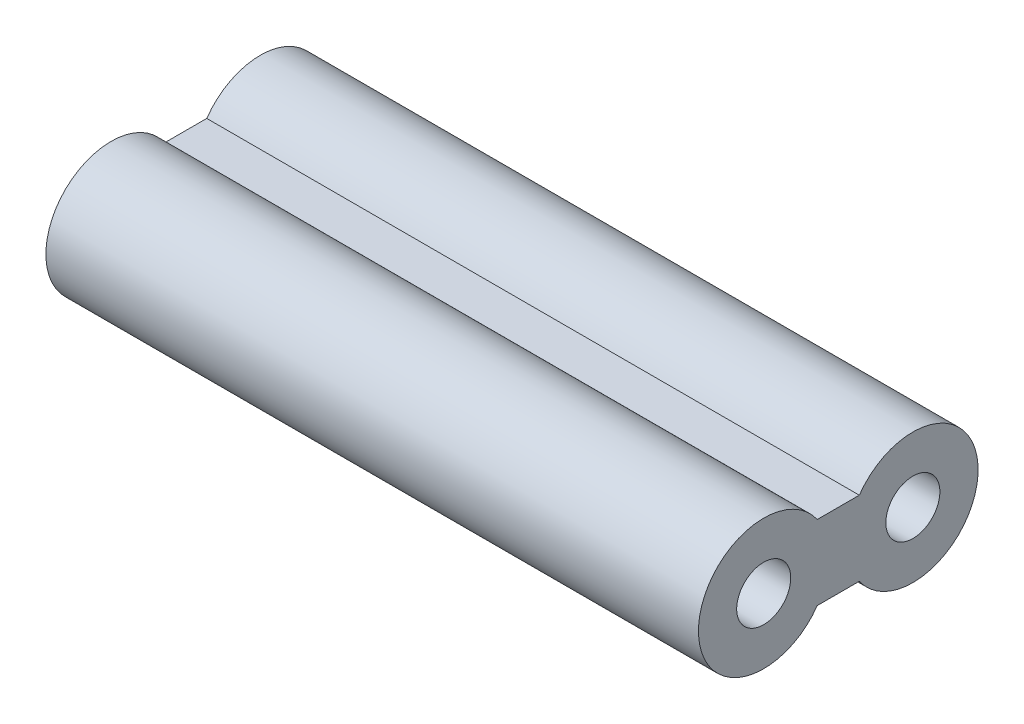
ISO-10303-21;
HEADER;
FILE_DESCRIPTION(('STEP AP214'),'2;1');
FILE_NAME('part.step','',(''),(''),'','','');
FILE_SCHEMA(('AUTOMOTIVE_DESIGN { 1 0 10303 214 1 1 1 1 }'));
ENDSEC;
DATA;
#1=APPLICATION_CONTEXT('core data for automotive mechanical design processes');
#2=APPLICATION_PROTOCOL_DEFINITION('international standard','automotive_design',2000,#1);
#3=PRODUCT_CONTEXT('',#1,'mechanical');
#4=PRODUCT('Part','Part','',(#3));
#5=PRODUCT_RELATED_PRODUCT_CATEGORY('part','',(#4));
#6=PRODUCT_DEFINITION_FORMATION('','',#4);
#7=PRODUCT_DEFINITION_CONTEXT('part definition',#1,'design');
#8=PRODUCT_DEFINITION('design','',#6,#7);
#9=PRODUCT_DEFINITION_SHAPE('','',#8);
#10=(LENGTH_UNIT() NAMED_UNIT(*) SI_UNIT(.MILLI.,.METRE.));
#11=(NAMED_UNIT(*) PLANE_ANGLE_UNIT() SI_UNIT($,.RADIAN.));
#12=(NAMED_UNIT(*) SI_UNIT($,.STERADIAN.) SOLID_ANGLE_UNIT());
#13=UNCERTAINTY_MEASURE_WITH_UNIT(LENGTH_MEASURE(1.E-05),#10,'distance_accuracy_value','');
#14=(GEOMETRIC_REPRESENTATION_CONTEXT(3) GLOBAL_UNCERTAINTY_ASSIGNED_CONTEXT((#13)) GLOBAL_UNIT_ASSIGNED_CONTEXT((#10,
#11,#12)) REPRESENTATION_CONTEXT('',''));
#15=CARTESIAN_POINT('',(0.,0.,0.));
#16=DIRECTION('',(0.,0.,1.));
#17=DIRECTION('',(1.,0.,0.));
#18=AXIS2_PLACEMENT_3D('',#15,#16,#17);
#19=CARTESIAN_POINT('',(17.5,0.,0.));
#20=DIRECTION('',(1.,0.,0.));
#21=DIRECTION('',(0.,0.,-1.));
#22=AXIS2_PLACEMENT_3D('',#19,#20,#21);
#23=PLANE('',#22);
#24=CARTESIAN_POINT('',(17.5,0.,0.));
#25=DIRECTION('',(1.,0.,0.));
#26=DIRECTION('',(0.,0.,-1.));
#27=AXIS2_PLACEMENT_3D('',#24,#25,#26);
#28=CIRCLE('',#27,3.5);
#29=CARTESIAN_POINT('',(17.5,2.,-2.87228132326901));
#30=VERTEX_POINT('',#29);
#31=CARTESIAN_POINT('',(17.5,-2.,-2.87228132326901));
#32=VERTEX_POINT('',#31);
#33=EDGE_CURVE('E11',#30,#32,#28,.T.);
#34=ORIENTED_EDGE('',*,*,#33,.T.);
#35=DIRECTION('',(0.,0.,-1.));
#36=VECTOR('',#35,1.);
#37=CARTESIAN_POINT('',(17.5,-2.,-2.87228132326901));
#38=LINE('',#37,#36);
#39=CARTESIAN_POINT('',(17.5,-2.,-5.12771867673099));
#40=VERTEX_POINT('',#39);
#41=EDGE_CURVE('E76',#32,#40,#38,.T.);
#42=ORIENTED_EDGE('',*,*,#41,.T.);
#43=CARTESIAN_POINT('',(17.5,0.,-8.));
#44=DIRECTION('',(1.,0.,0.));
#45=DIRECTION('',(0.,0.,-1.));
#46=AXIS2_PLACEMENT_3D('',#43,#44,#45);
#47=CIRCLE('',#46,3.5);
#48=CARTESIAN_POINT('',(17.5,2.,-5.12771867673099));
#49=VERTEX_POINT('',#48);
#50=EDGE_CURVE('E83',#40,#49,#47,.T.);
#51=ORIENTED_EDGE('',*,*,#50,.T.);
#52=DIRECTION('',(0.,0.,1.));
#53=VECTOR('',#52,1.);
#54=CARTESIAN_POINT('',(17.5,2.,-2.87228132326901));
#55=LINE('',#54,#53);
#56=EDGE_CURVE('E89',#49,#30,#55,.T.);
#57=ORIENTED_EDGE('',*,*,#56,.T.);
#58=EDGE_LOOP('',(#34,#42,#51,#57));
#59=FACE_BOUND('',#58,.T.);
#60=CARTESIAN_POINT('',(17.5,0.,0.));
#61=DIRECTION('',(1.,0.,0.));
#62=DIRECTION('',(0.,0.,-1.));
#63=AXIS2_PLACEMENT_3D('',#60,#61,#62);
#64=CIRCLE('',#63,1.45);
#65=CARTESIAN_POINT('',(17.5,0.,-1.45));
#66=VERTEX_POINT('',#65);
#67=EDGE_CURVE('E109',#66,#66,#64,.T.);
#68=ORIENTED_EDGE('',*,*,#67,.F.);
#69=EDGE_LOOP('',(#68));
#70=FACE_BOUND('',#69,.T.);
#71=CARTESIAN_POINT('',(17.5,0.,-8.));
#72=DIRECTION('',(1.,0.,0.));
#73=DIRECTION('',(0.,0.,-1.));
#74=AXIS2_PLACEMENT_3D('',#71,#72,#73);
#75=CIRCLE('',#74,1.45);
#76=CARTESIAN_POINT('',(17.5,0.,-9.45));
#77=VERTEX_POINT('',#76);
#78=EDGE_CURVE('E92',#77,#77,#75,.T.);
#79=ORIENTED_EDGE('',*,*,#78,.F.);
#80=EDGE_LOOP('',(#79));
#81=FACE_BOUND('',#80,.T.);
#82=ADVANCED_FACE('F33',(#59,#70,#81),#23,.T.);
#83=CARTESIAN_POINT('',(-17.5,0.,0.));
#84=DIRECTION('',(1.,0.,0.));
#85=DIRECTION('',(0.,0.,-1.));
#86=AXIS2_PLACEMENT_3D('',#83,#84,#85);
#87=PLANE('',#86);
#88=CARTESIAN_POINT('',(-17.5,0.,0.));
#89=DIRECTION('',(1.,0.,0.));
#90=DIRECTION('',(0.,0.,-1.));
#91=AXIS2_PLACEMENT_3D('',#88,#89,#90);
#92=CIRCLE('',#91,3.5);
#93=CARTESIAN_POINT('',(-17.5,2.,-2.87228132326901));
#94=VERTEX_POINT('',#93);
#95=CARTESIAN_POINT('',(-17.5,-2.,-2.87228132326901));
#96=VERTEX_POINT('',#95);
#97=EDGE_CURVE('E37',#94,#96,#92,.T.);
#98=ORIENTED_EDGE('',*,*,#97,.F.);
#99=DIRECTION('',(0.,0.,-1.));
#100=VECTOR('',#99,1.);
#101=CARTESIAN_POINT('',(-17.5,2.,-2.87228132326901));
#102=LINE('',#101,#100);
#103=CARTESIAN_POINT('',(-17.5,2.,-5.12771867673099));
#104=VERTEX_POINT('',#103);
#105=EDGE_CURVE('E136',#94,#104,#102,.T.);
#106=ORIENTED_EDGE('',*,*,#105,.T.);
#107=CARTESIAN_POINT('',(-17.5,0.,-8.));
#108=DIRECTION('',(1.,0.,0.));
#109=DIRECTION('',(0.,0.,-1.));
#110=AXIS2_PLACEMENT_3D('',#107,#108,#109);
#111=CIRCLE('',#110,3.5);
#112=CARTESIAN_POINT('',(-17.5,-2.,-5.12771867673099));
#113=VERTEX_POINT('',#112);
#114=EDGE_CURVE('E102',#104,#113,#111,.F.);
#115=ORIENTED_EDGE('',*,*,#114,.T.);
#116=DIRECTION('',(0.,0.,1.));
#117=VECTOR('',#116,1.);
#118=CARTESIAN_POINT('',(-17.5,-2.,-2.87228132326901));
#119=LINE('',#118,#117);
#120=EDGE_CURVE('E77',#113,#96,#119,.T.);
#121=ORIENTED_EDGE('',*,*,#120,.T.);
#122=EDGE_LOOP('',(#98,#106,#115,#121));
#123=FACE_BOUND('',#122,.T.);
#124=CARTESIAN_POINT('',(-17.5,0.,0.));
#125=DIRECTION('',(1.,0.,0.));
#126=DIRECTION('',(0.,0.,-1.));
#127=AXIS2_PLACEMENT_3D('',#124,#125,#126);
#128=CIRCLE('',#127,1.45);
#129=CARTESIAN_POINT('',(-17.5,0.,-1.45));
#130=VERTEX_POINT('',#129);
#131=EDGE_CURVE('E108',#130,#130,#128,.T.);
#132=ORIENTED_EDGE('',*,*,#131,.T.);
#133=EDGE_LOOP('',(#132));
#134=FACE_BOUND('',#133,.T.);
#135=CARTESIAN_POINT('',(-17.5,0.,-8.));
#136=DIRECTION('',(1.,0.,0.));
#137=DIRECTION('',(0.,0.,-1.));
#138=AXIS2_PLACEMENT_3D('',#135,#136,#137);
#139=CIRCLE('',#138,1.45);
#140=CARTESIAN_POINT('',(-17.5,0.,-9.45));
#141=VERTEX_POINT('',#140);
#142=EDGE_CURVE('E105',#141,#141,#139,.F.);
#143=ORIENTED_EDGE('',*,*,#142,.F.);
#144=EDGE_LOOP('',(#143));
#145=FACE_BOUND('',#144,.T.);
#146=ADVANCED_FACE('F115',(#123,#134,#145),#87,.F.);
#147=CARTESIAN_POINT('',(17.5,0.,0.));
#148=DIRECTION('',(-1.,0.,0.));
#149=DIRECTION('',(0.,0.,1.));
#150=AXIS2_PLACEMENT_3D('',#147,#148,#149);
#151=CYLINDRICAL_SURFACE('',#150,3.5);
#152=ORIENTED_EDGE('',*,*,#97,.T.);
#153=DIRECTION('',(1.,0.,0.));
#154=VECTOR('',#153,1.);
#155=CARTESIAN_POINT('',(-28.6102443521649,-2.,-2.87228132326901));
#156=LINE('',#155,#154);
#157=EDGE_CURVE('E52',#96,#32,#156,.T.);
#158=ORIENTED_EDGE('',*,*,#157,.T.);
#159=ORIENTED_EDGE('',*,*,#33,.F.);
#160=DIRECTION('',(1.,0.,0.));
#161=VECTOR('',#160,1.);
#162=CARTESIAN_POINT('',(-28.6102443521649,2.,-2.87228132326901));
#163=LINE('',#162,#161);
#164=EDGE_CURVE('E99',#94,#30,#163,.T.);
#165=ORIENTED_EDGE('',*,*,#164,.F.);
#166=EDGE_LOOP('',(#152,#158,#159,#165));
#167=FACE_BOUND('',#166,.T.);
#168=ADVANCED_FACE('F35',(#167),#151,.T.);
#169=CARTESIAN_POINT('',(17.5,0.,0.));
#170=DIRECTION('',(-1.,0.,0.));
#171=DIRECTION('',(0.,0.,1.));
#172=AXIS2_PLACEMENT_3D('',#169,#170,#171);
#173=CYLINDRICAL_SURFACE('',#172,1.45);
#174=ORIENTED_EDGE('',*,*,#67,.T.);
#175=EDGE_LOOP('',(#174));
#176=FACE_BOUND('',#175,.T.);
#177=ORIENTED_EDGE('',*,*,#131,.F.);
#178=EDGE_LOOP('',(#177));
#179=FACE_BOUND('',#178,.T.);
#180=ADVANCED_FACE('F118',(#176,#179),#173,.F.);
#181=CARTESIAN_POINT('',(-28.6102443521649,-2.,-2.87228132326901));
#182=DIRECTION('',(0.,-1.,0.));
#183=DIRECTION('',(0.,0.,-1.));
#184=AXIS2_PLACEMENT_3D('',#181,#182,#183);
#185=PLANE('',#184);
#186=ORIENTED_EDGE('',*,*,#120,.F.);
#187=DIRECTION('',(1.,0.,0.));
#188=VECTOR('',#187,1.);
#189=CARTESIAN_POINT('',(-28.6102443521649,-2.,-5.12771867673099));
#190=LINE('',#189,#188);
#191=EDGE_CURVE('E72',#113,#40,#190,.T.);
#192=ORIENTED_EDGE('',*,*,#191,.T.);
#193=ORIENTED_EDGE('',*,*,#41,.F.);
#194=ORIENTED_EDGE('',*,*,#157,.F.);
#195=EDGE_LOOP('',(#186,#192,#193,#194));
#196=FACE_BOUND('',#195,.T.);
#197=ADVANCED_FACE('F74',(#196),#185,.T.);
#198=CARTESIAN_POINT('',(-28.6102443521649,0.,-8.));
#199=DIRECTION('',(1.,0.,0.));
#200=DIRECTION('',(0.,0.,-1.));
#201=AXIS2_PLACEMENT_3D('',#198,#199,#200);
#202=CYLINDRICAL_SURFACE('',#201,3.5);
#203=ORIENTED_EDGE('',*,*,#114,.F.);
#204=DIRECTION('',(1.,0.,0.));
#205=VECTOR('',#204,1.);
#206=CARTESIAN_POINT('',(-28.6102443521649,2.,-5.12771867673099));
#207=LINE('',#206,#205);
#208=EDGE_CURVE('E80',#104,#49,#207,.T.);
#209=ORIENTED_EDGE('',*,*,#208,.T.);
#210=ORIENTED_EDGE('',*,*,#50,.F.);
#211=ORIENTED_EDGE('',*,*,#191,.F.);
#212=EDGE_LOOP('',(#203,#209,#210,#211));
#213=FACE_BOUND('',#212,.T.);
#214=ADVANCED_FACE('F84',(#213),#202,.T.);
#215=CARTESIAN_POINT('',(-28.6102443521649,2.,-2.87228132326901));
#216=DIRECTION('',(0.,1.,0.));
#217=DIRECTION('',(0.,0.,1.));
#218=AXIS2_PLACEMENT_3D('',#215,#216,#217);
#219=PLANE('',#218);
#220=ORIENTED_EDGE('',*,*,#105,.F.);
#221=ORIENTED_EDGE('',*,*,#164,.T.);
#222=ORIENTED_EDGE('',*,*,#56,.F.);
#223=ORIENTED_EDGE('',*,*,#208,.F.);
#224=EDGE_LOOP('',(#220,#221,#222,#223));
#225=FACE_BOUND('',#224,.T.);
#226=ADVANCED_FACE('F138',(#225),#219,.T.);
#227=CARTESIAN_POINT('',(-28.6102443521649,0.,-8.));
#228=DIRECTION('',(1.,0.,0.));
#229=DIRECTION('',(0.,0.,-1.));
#230=AXIS2_PLACEMENT_3D('',#227,#228,#229);
#231=CYLINDRICAL_SURFACE('',#230,1.45);
#232=ORIENTED_EDGE('',*,*,#142,.T.);
#233=EDGE_LOOP('',(#232));
#234=FACE_BOUND('',#233,.T.);
#235=ORIENTED_EDGE('',*,*,#78,.T.);
#236=EDGE_LOOP('',(#235));
#237=FACE_BOUND('',#236,.T.);
#238=ADVANCED_FACE('F142',(#234,#237),#231,.F.);
#239=CLOSED_SHELL('',(#82,#146,#168,#180,#197,#214,#226,#238));
#240=MANIFOLD_SOLID_BREP('B2',#239);
#241=ADVANCED_BREP_SHAPE_REPRESENTATION('',(#18,#240),#14);
#242=SHAPE_DEFINITION_REPRESENTATION(#9,#241);
ENDSEC;
END-ISO-10303-21;
